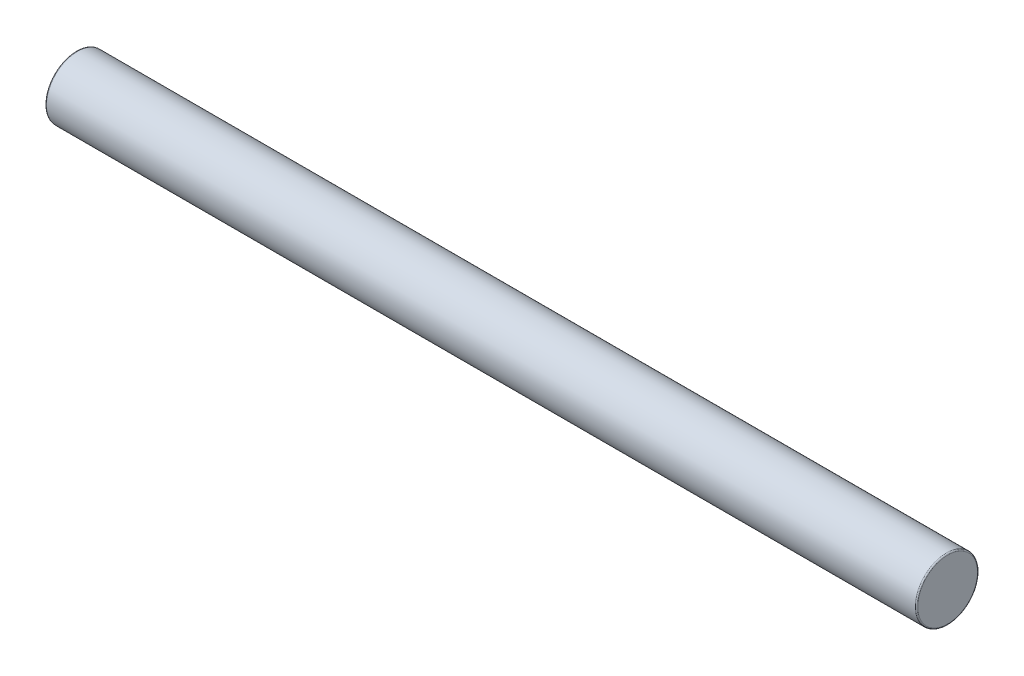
from build123d import *

# Parameters (mm, degrees)
SKETCH1_R           = 5
BOSS_EXTRUDE1_DEPTH = 140
FILLET1_R           = 0.2


with BuildPart() as part:
    # Sketch1 → Boss-Extrude1 (new body)
    with BuildSketch(Plane(origin=(0, 0, 0), x_dir=(0, 0, -1), z_dir=(1, 0, 0))):
        Circle(SKETCH1_R)
    extrude(amount=BOSS_EXTRUDE1_DEPTH)

    # Fillet1
    fillet1_edges = [part.edges().sort_by_distance(p)[0] for p in [
        (0, 0, 5),
        (140, 0, 5),
    ]]
    fillet(fillet1_edges, radius=FILLET1_R)


solid = part.part
